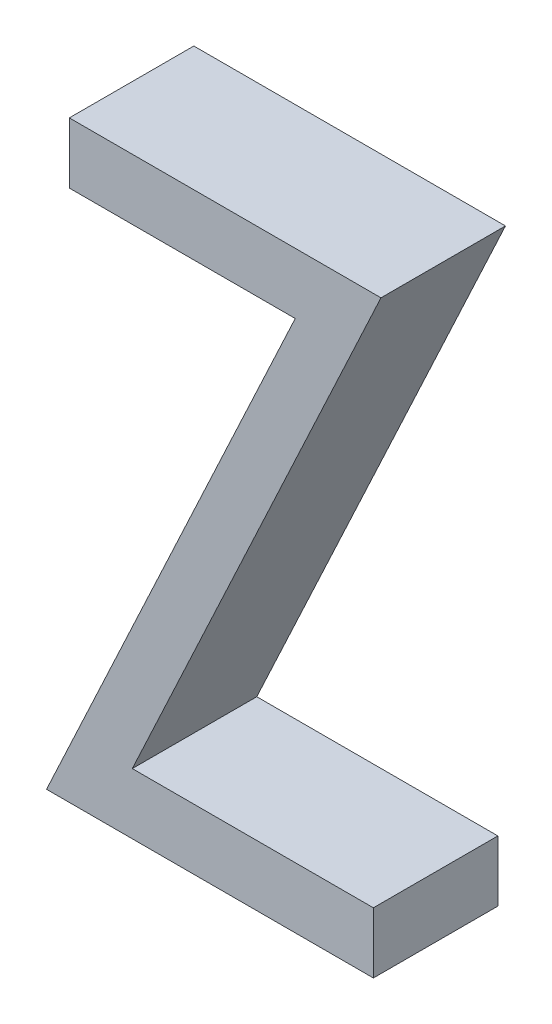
ISO-10303-21;
HEADER;
FILE_DESCRIPTION(('STEP AP214'),'2;1');
FILE_NAME('part.step','',(''),(''),'','','');
FILE_SCHEMA(('AUTOMOTIVE_DESIGN { 1 0 10303 214 1 1 1 1 }'));
ENDSEC;
DATA;
#1=APPLICATION_CONTEXT('core data for automotive mechanical design processes');
#2=APPLICATION_PROTOCOL_DEFINITION('international standard','automotive_design',2000,#1);
#3=PRODUCT_CONTEXT('',#1,'mechanical');
#4=PRODUCT('Part','Part','',(#3));
#5=PRODUCT_RELATED_PRODUCT_CATEGORY('part','',(#4));
#6=PRODUCT_DEFINITION_FORMATION('','',#4);
#7=PRODUCT_DEFINITION_CONTEXT('part definition',#1,'design');
#8=PRODUCT_DEFINITION('design','',#6,#7);
#9=PRODUCT_DEFINITION_SHAPE('','',#8);
#10=(LENGTH_UNIT() NAMED_UNIT(*) SI_UNIT(.MILLI.,.METRE.));
#11=(NAMED_UNIT(*) PLANE_ANGLE_UNIT() SI_UNIT($,.RADIAN.));
#12=(NAMED_UNIT(*) SI_UNIT($,.STERADIAN.) SOLID_ANGLE_UNIT());
#13=UNCERTAINTY_MEASURE_WITH_UNIT(LENGTH_MEASURE(1.E-05),#10,'distance_accuracy_value','');
#14=(GEOMETRIC_REPRESENTATION_CONTEXT(3) GLOBAL_UNCERTAINTY_ASSIGNED_CONTEXT((#13)) GLOBAL_UNIT_ASSIGNED_CONTEXT((#10,
#11,#12)) REPRESENTATION_CONTEXT('',''));
#15=CARTESIAN_POINT('',(0.,0.,0.));
#16=DIRECTION('',(0.,0.,1.));
#17=DIRECTION('',(1.,0.,0.));
#18=AXIS2_PLACEMENT_3D('',#15,#16,#17);
#19=CARTESIAN_POINT('',(-25.5267485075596,226.305606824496,2.));
#20=DIRECTION('',(0.,-1.,0.));
#21=DIRECTION('',(0.,0.,-1.));
#22=AXIS2_PLACEMENT_3D('',#19,#20,#21);
#23=PLANE('',#22);
#24=DIRECTION('',(-1.,0.,0.));
#25=VECTOR('',#24,1.);
#26=CARTESIAN_POINT('',(-25.5267485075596,226.305606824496,-2.));
#27=LINE('',#26,#25);
#28=CARTESIAN_POINT('',(-25.5267485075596,226.305606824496,-2.));
#29=VERTEX_POINT('',#28);
#30=CARTESIAN_POINT('',(-32.7849816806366,226.305606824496,-2.));
#31=VERTEX_POINT('',#30);
#32=EDGE_CURVE('E132',#29,#31,#27,.T.);
#33=ORIENTED_EDGE('',*,*,#32,.F.);
#34=DIRECTION('',(0.,0.,-1.));
#35=VECTOR('',#34,1.);
#36=CARTESIAN_POINT('',(-25.5267485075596,226.305606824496,2.));
#37=LINE('',#36,#35);
#38=CARTESIAN_POINT('',(-25.5267485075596,226.305606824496,2.));
#39=VERTEX_POINT('',#38);
#40=EDGE_CURVE('E11',#39,#29,#37,.T.);
#41=ORIENTED_EDGE('',*,*,#40,.F.);
#42=DIRECTION('',(-1.,0.,0.));
#43=VECTOR('',#42,1.);
#44=CARTESIAN_POINT('',(-25.5267485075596,226.305606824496,2.));
#45=LINE('',#44,#43);
#46=CARTESIAN_POINT('',(-32.7849816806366,226.305606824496,2.));
#47=VERTEX_POINT('',#46);
#48=EDGE_CURVE('E152',#39,#47,#45,.T.);
#49=ORIENTED_EDGE('',*,*,#48,.T.);
#50=DIRECTION('',(0.,0.,-1.));
#51=VECTOR('',#50,1.);
#52=CARTESIAN_POINT('',(-32.7849816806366,226.305606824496,2.));
#53=LINE('',#52,#51);
#54=EDGE_CURVE('E38',#47,#31,#53,.T.);
#55=ORIENTED_EDGE('',*,*,#54,.T.);
#56=EDGE_LOOP('',(#33,#41,#49,#55));
#57=FACE_BOUND('',#56,.T.);
#58=ADVANCED_FACE('F35',(#57),#23,.T.);
#59=CARTESIAN_POINT('',(-33.5176739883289,209.209452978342,2.));
#60=DIRECTION('',(-0.905924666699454,0.423438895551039,0.));
#61=DIRECTION('',(-0.423438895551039,-0.905924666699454,0.));
#62=AXIS2_PLACEMENT_3D('',#59,#60,#61);
#63=PLANE('',#62);
#64=DIRECTION('',(0.423438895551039,0.905924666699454,0.));
#65=VECTOR('',#64,1.);
#66=CARTESIAN_POINT('',(-33.5176739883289,209.209452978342,-2.));
#67=LINE('',#66,#65);
#68=CARTESIAN_POINT('',(-33.5176739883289,209.209452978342,-2.));
#69=VERTEX_POINT('',#68);
#70=EDGE_CURVE('E150',#69,#29,#67,.T.);
#71=ORIENTED_EDGE('',*,*,#70,.F.);
#72=DIRECTION('',(0.,0.,-1.));
#73=VECTOR('',#72,1.);
#74=CARTESIAN_POINT('',(-33.5176739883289,209.209452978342,2.));
#75=LINE('',#74,#73);
#76=CARTESIAN_POINT('',(-33.5176739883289,209.209452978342,2.));
#77=VERTEX_POINT('',#76);
#78=EDGE_CURVE('E44',#77,#69,#75,.T.);
#79=ORIENTED_EDGE('',*,*,#78,.F.);
#80=DIRECTION('',(0.423438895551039,0.905924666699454,0.));
#81=VECTOR('',#80,1.);
#82=CARTESIAN_POINT('',(-33.5176739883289,209.209452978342,2.));
#83=LINE('',#82,#81);
#84=EDGE_CURVE('E122',#77,#39,#83,.T.);
#85=ORIENTED_EDGE('',*,*,#84,.T.);
#86=ORIENTED_EDGE('',*,*,#40,.T.);
#87=EDGE_LOOP('',(#71,#79,#85,#86));
#88=FACE_BOUND('',#87,.T.);
#89=ADVANCED_FACE('F164',(#88),#63,.T.);
#90=CARTESIAN_POINT('',(-23.0157509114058,209.209452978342,2.));
#91=DIRECTION('',(0.,-1.,0.));
#92=DIRECTION('',(0.,0.,-1.));
#93=AXIS2_PLACEMENT_3D('',#90,#91,#92);
#94=PLANE('',#93);
#95=DIRECTION('',(-1.,0.,0.));
#96=VECTOR('',#95,1.);
#97=CARTESIAN_POINT('',(-23.0157509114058,209.209452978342,-2.));
#98=LINE('',#97,#96);
#99=CARTESIAN_POINT('',(-23.0157509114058,209.209452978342,-2.));
#100=VERTEX_POINT('',#99);
#101=EDGE_CURVE('E109',#100,#69,#98,.T.);
#102=ORIENTED_EDGE('',*,*,#101,.F.);
#103=DIRECTION('',(0.,0.,-1.));
#104=VECTOR('',#103,1.);
#105=CARTESIAN_POINT('',(-23.0157509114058,209.209452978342,2.));
#106=LINE('',#105,#104);
#107=CARTESIAN_POINT('',(-23.0157509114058,209.209452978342,2.));
#108=VERTEX_POINT('',#107);
#109=EDGE_CURVE('E104',#108,#100,#106,.T.);
#110=ORIENTED_EDGE('',*,*,#109,.F.);
#111=DIRECTION('',(-1.,0.,0.));
#112=VECTOR('',#111,1.);
#113=CARTESIAN_POINT('',(-23.0157509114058,209.209452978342,2.));
#114=LINE('',#113,#112);
#115=EDGE_CURVE('E107',#108,#77,#114,.T.);
#116=ORIENTED_EDGE('',*,*,#115,.T.);
#117=ORIENTED_EDGE('',*,*,#78,.T.);
#118=EDGE_LOOP('',(#102,#110,#116,#117));
#119=FACE_BOUND('',#118,.T.);
#120=ADVANCED_FACE('F106',(#119),#94,.T.);
#121=CARTESIAN_POINT('',(-23.0157509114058,211.163299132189,2.));
#122=DIRECTION('',(1.,0.,0.));
#123=DIRECTION('',(0.,0.,-1.));
#124=AXIS2_PLACEMENT_3D('',#121,#122,#123);
#125=PLANE('',#124);
#126=DIRECTION('',(0.,-1.,0.));
#127=VECTOR('',#126,1.);
#128=CARTESIAN_POINT('',(-23.0157509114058,211.163299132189,-2.));
#129=LINE('',#128,#127);
#130=CARTESIAN_POINT('',(-23.0157509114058,211.163299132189,-2.));
#131=VERTEX_POINT('',#130);
#132=EDGE_CURVE('E147',#131,#100,#129,.T.);
#133=ORIENTED_EDGE('',*,*,#132,.F.);
#134=DIRECTION('',(0.,0.,-1.));
#135=VECTOR('',#134,1.);
#136=CARTESIAN_POINT('',(-23.0157509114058,211.163299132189,2.));
#137=LINE('',#136,#135);
#138=CARTESIAN_POINT('',(-23.0157509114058,211.163299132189,2.));
#139=VERTEX_POINT('',#138);
#140=EDGE_CURVE('E114',#139,#131,#137,.T.);
#141=ORIENTED_EDGE('',*,*,#140,.F.);
#142=DIRECTION('',(0.,-1.,0.));
#143=VECTOR('',#142,1.);
#144=CARTESIAN_POINT('',(-23.0157509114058,211.163299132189,2.));
#145=LINE('',#144,#143);
#146=EDGE_CURVE('E120',#139,#108,#145,.T.);
#147=ORIENTED_EDGE('',*,*,#146,.T.);
#148=ORIENTED_EDGE('',*,*,#109,.T.);
#149=EDGE_LOOP('',(#133,#141,#147,#148));
#150=FACE_BOUND('',#149,.T.);
#151=ADVANCED_FACE('F124',(#150),#125,.T.);
#152=CARTESIAN_POINT('',(-30.7624456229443,211.163299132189,2.));
#153=DIRECTION('',(0.,1.,0.));
#154=DIRECTION('',(0.,0.,1.));
#155=AXIS2_PLACEMENT_3D('',#152,#153,#154);
#156=PLANE('',#155);
#157=DIRECTION('',(1.,0.,0.));
#158=VECTOR('',#157,1.);
#159=CARTESIAN_POINT('',(-30.7624456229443,211.163299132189,-2.));
#160=LINE('',#159,#158);
#161=CARTESIAN_POINT('',(-30.7624456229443,211.163299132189,-2.));
#162=VERTEX_POINT('',#161);
#163=EDGE_CURVE('E144',#162,#131,#160,.T.);
#164=ORIENTED_EDGE('',*,*,#163,.F.);
#165=DIRECTION('',(0.,0.,-1.));
#166=VECTOR('',#165,1.);
#167=CARTESIAN_POINT('',(-30.7624456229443,211.163299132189,2.));
#168=LINE('',#167,#166);
#169=CARTESIAN_POINT('',(-30.7624456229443,211.163299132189,2.));
#170=VERTEX_POINT('',#169);
#171=EDGE_CURVE('E156',#170,#162,#168,.T.);
#172=ORIENTED_EDGE('',*,*,#171,.F.);
#173=DIRECTION('',(1.,0.,0.));
#174=VECTOR('',#173,1.);
#175=CARTESIAN_POINT('',(-30.7624456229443,211.163299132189,2.));
#176=LINE('',#175,#174);
#177=EDGE_CURVE('E125',#170,#139,#176,.T.);
#178=ORIENTED_EDGE('',*,*,#177,.T.);
#179=ORIENTED_EDGE('',*,*,#140,.T.);
#180=EDGE_LOOP('',(#164,#172,#178,#179));
#181=FACE_BOUND('',#180,.T.);
#182=ADVANCED_FACE('F177',(#181),#156,.T.);
#183=CARTESIAN_POINT('',(-22.771520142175,228.259452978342,2.));
#184=DIRECTION('',(0.905924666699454,-0.423438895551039,0.));
#185=DIRECTION('',(0.423438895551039,0.905924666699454,0.));
#186=AXIS2_PLACEMENT_3D('',#183,#184,#185);
#187=PLANE('',#186);
#188=DIRECTION('',(-0.423438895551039,-0.905924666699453,0.));
#189=VECTOR('',#188,1.);
#190=CARTESIAN_POINT('',(-22.771520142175,228.259452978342,-2.));
#191=LINE('',#190,#189);
#192=CARTESIAN_POINT('',(-22.771520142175,228.259452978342,-2.));
#193=VERTEX_POINT('',#192);
#194=EDGE_CURVE('E141',#193,#162,#191,.T.);
#195=ORIENTED_EDGE('',*,*,#194,.F.);
#196=DIRECTION('',(0.,0.,-1.));
#197=VECTOR('',#196,1.);
#198=CARTESIAN_POINT('',(-22.771520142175,228.259452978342,2.));
#199=LINE('',#198,#197);
#200=CARTESIAN_POINT('',(-22.771520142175,228.259452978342,2.));
#201=VERTEX_POINT('',#200);
#202=EDGE_CURVE('E158',#201,#193,#199,.T.);
#203=ORIENTED_EDGE('',*,*,#202,.F.);
#204=DIRECTION('',(-0.423438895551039,-0.905924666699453,0.));
#205=VECTOR('',#204,1.);
#206=CARTESIAN_POINT('',(-22.771520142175,228.259452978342,2.));
#207=LINE('',#206,#205);
#208=EDGE_CURVE('E127',#201,#170,#207,.T.);
#209=ORIENTED_EDGE('',*,*,#208,.T.);
#210=ORIENTED_EDGE('',*,*,#171,.T.);
#211=EDGE_LOOP('',(#195,#203,#209,#210));
#212=FACE_BOUND('',#211,.T.);
#213=ADVANCED_FACE('F180',(#212),#187,.T.);
#214=CARTESIAN_POINT('',(-32.7849816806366,228.259452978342,2.));
#215=DIRECTION('',(0.,1.,0.));
#216=DIRECTION('',(0.,0.,1.));
#217=AXIS2_PLACEMENT_3D('',#214,#215,#216);
#218=PLANE('',#217);
#219=DIRECTION('',(1.,0.,0.));
#220=VECTOR('',#219,1.);
#221=CARTESIAN_POINT('',(-32.7849816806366,228.259452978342,-2.));
#222=LINE('',#221,#220);
#223=CARTESIAN_POINT('',(-32.7849816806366,228.259452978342,-2.));
#224=VERTEX_POINT('',#223);
#225=EDGE_CURVE('E138',#224,#193,#222,.T.);
#226=ORIENTED_EDGE('',*,*,#225,.F.);
#227=DIRECTION('',(0.,0.,-1.));
#228=VECTOR('',#227,1.);
#229=CARTESIAN_POINT('',(-32.7849816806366,228.259452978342,2.));
#230=LINE('',#229,#228);
#231=CARTESIAN_POINT('',(-32.7849816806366,228.259452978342,2.));
#232=VERTEX_POINT('',#231);
#233=EDGE_CURVE('E159',#232,#224,#230,.T.);
#234=ORIENTED_EDGE('',*,*,#233,.F.);
#235=DIRECTION('',(1.,0.,0.));
#236=VECTOR('',#235,1.);
#237=CARTESIAN_POINT('',(-32.7849816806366,228.259452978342,2.));
#238=LINE('',#237,#236);
#239=EDGE_CURVE('E285',#232,#201,#238,.T.);
#240=ORIENTED_EDGE('',*,*,#239,.T.);
#241=ORIENTED_EDGE('',*,*,#202,.T.);
#242=EDGE_LOOP('',(#226,#234,#240,#241));
#243=FACE_BOUND('',#242,.T.);
#244=ADVANCED_FACE('F184',(#243),#218,.T.);
#245=CARTESIAN_POINT('',(-32.7849816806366,226.305606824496,2.));
#246=DIRECTION('',(-1.,0.,0.));
#247=DIRECTION('',(0.,0.,1.));
#248=AXIS2_PLACEMENT_3D('',#245,#246,#247);
#249=PLANE('',#248);
#250=DIRECTION('',(0.,1.,0.));
#251=VECTOR('',#250,1.);
#252=CARTESIAN_POINT('',(-32.7849816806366,226.305606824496,-2.));
#253=LINE('',#252,#251);
#254=EDGE_CURVE('E135',#31,#224,#253,.T.);
#255=ORIENTED_EDGE('',*,*,#254,.F.);
#256=ORIENTED_EDGE('',*,*,#54,.F.);
#257=DIRECTION('',(0.,1.,0.));
#258=VECTOR('',#257,1.);
#259=CARTESIAN_POINT('',(-32.7849816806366,226.305606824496,2.));
#260=LINE('',#259,#258);
#261=EDGE_CURVE('E286',#47,#232,#260,.T.);
#262=ORIENTED_EDGE('',*,*,#261,.T.);
#263=ORIENTED_EDGE('',*,*,#233,.T.);
#264=EDGE_LOOP('',(#255,#256,#262,#263));
#265=FACE_BOUND('',#264,.T.);
#266=ADVANCED_FACE('F161',(#265),#249,.T.);
#267=CARTESIAN_POINT('',(-32.7849816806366,226.305606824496,2.));
#268=DIRECTION('',(0.,0.,-1.));
#269=DIRECTION('',(-1.,0.,0.));
#270=AXIS2_PLACEMENT_3D('',#267,#268,#269);
#271=PLANE('',#270);
#272=ORIENTED_EDGE('',*,*,#48,.F.);
#273=ORIENTED_EDGE('',*,*,#84,.F.);
#274=ORIENTED_EDGE('',*,*,#115,.F.);
#275=ORIENTED_EDGE('',*,*,#146,.F.);
#276=ORIENTED_EDGE('',*,*,#177,.F.);
#277=ORIENTED_EDGE('',*,*,#208,.F.);
#278=ORIENTED_EDGE('',*,*,#239,.F.);
#279=ORIENTED_EDGE('',*,*,#261,.F.);
#280=EDGE_LOOP('',(#272,#273,#274,#275,#276,#277,#278,#279));
#281=FACE_BOUND('',#280,.T.);
#282=ADVANCED_FACE('F118',(#281),#271,.F.);
#283=CARTESIAN_POINT('',(-32.7849816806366,226.305606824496,-2.));
#284=DIRECTION('',(0.,0.,-1.));
#285=DIRECTION('',(-1.,0.,0.));
#286=AXIS2_PLACEMENT_3D('',#283,#284,#285);
#287=PLANE('',#286);
#288=ORIENTED_EDGE('',*,*,#32,.T.);
#289=ORIENTED_EDGE('',*,*,#254,.T.);
#290=ORIENTED_EDGE('',*,*,#225,.T.);
#291=ORIENTED_EDGE('',*,*,#194,.T.);
#292=ORIENTED_EDGE('',*,*,#163,.T.);
#293=ORIENTED_EDGE('',*,*,#132,.T.);
#294=ORIENTED_EDGE('',*,*,#101,.T.);
#295=ORIENTED_EDGE('',*,*,#70,.T.);
#296=EDGE_LOOP('',(#288,#289,#290,#291,#292,#293,#294,#295));
#297=FACE_BOUND('',#296,.T.);
#298=ADVANCED_FACE('F163',(#297),#287,.T.);
#299=CLOSED_SHELL('',(#58,#89,#120,#151,#182,#213,#244,#266,#282,#298));
#300=MANIFOLD_SOLID_BREP('B2',#299);
#301=ADVANCED_BREP_SHAPE_REPRESENTATION('',(#18,#300),#14);
#302=SHAPE_DEFINITION_REPRESENTATION(#9,#301);
ENDSEC;
END-ISO-10303-21;
